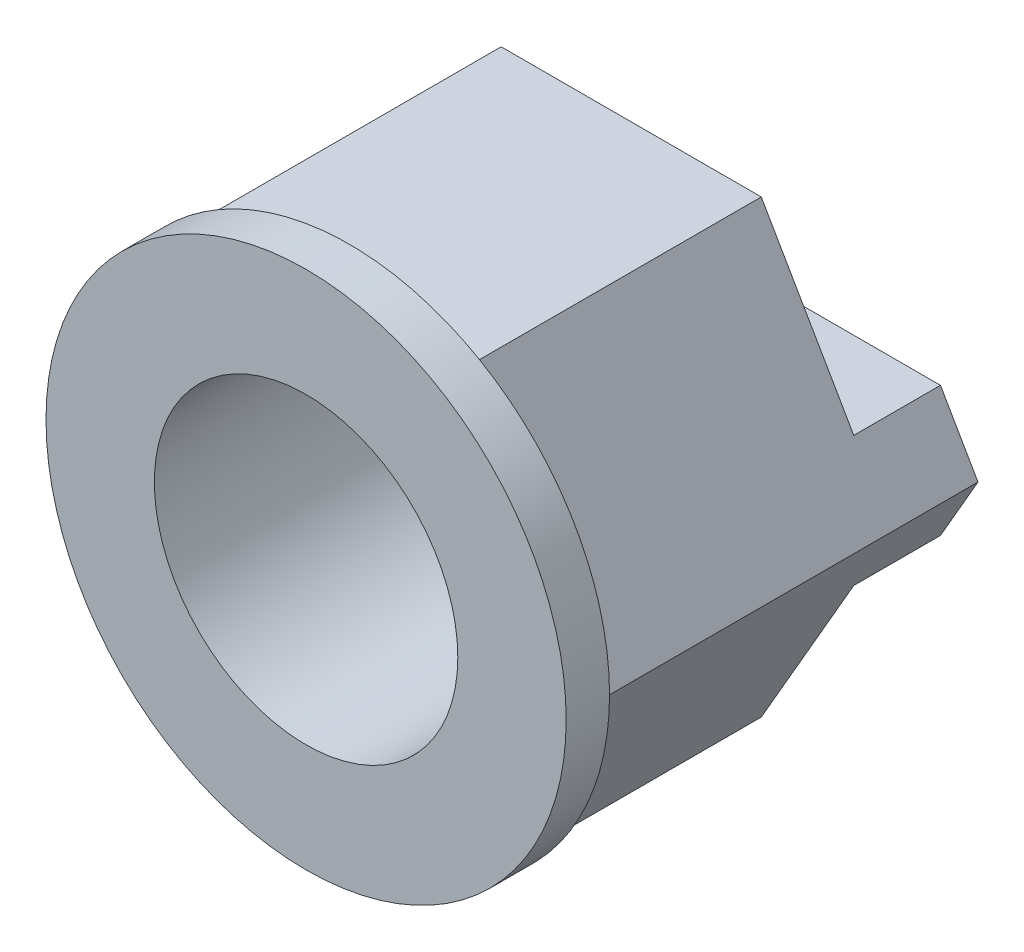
ISO-10303-21;
HEADER;
FILE_DESCRIPTION(('STEP AP214'),'2;1');
FILE_NAME('part.step','',(''),(''),'','','');
FILE_SCHEMA(('AUTOMOTIVE_DESIGN { 1 0 10303 214 1 1 1 1 }'));
ENDSEC;
DATA;
#1=APPLICATION_CONTEXT('core data for automotive mechanical design processes');
#2=APPLICATION_PROTOCOL_DEFINITION('international standard','automotive_design',2000,#1);
#3=PRODUCT_CONTEXT('',#1,'mechanical');
#4=PRODUCT('Part','Part','',(#3));
#5=PRODUCT_RELATED_PRODUCT_CATEGORY('part','',(#4));
#6=PRODUCT_DEFINITION_FORMATION('','',#4);
#7=PRODUCT_DEFINITION_CONTEXT('part definition',#1,'design');
#8=PRODUCT_DEFINITION('design','',#6,#7);
#9=PRODUCT_DEFINITION_SHAPE('','',#8);
#10=(LENGTH_UNIT() NAMED_UNIT(*) SI_UNIT(.MILLI.,.METRE.));
#11=(NAMED_UNIT(*) PLANE_ANGLE_UNIT() SI_UNIT($,.RADIAN.));
#12=(NAMED_UNIT(*) SI_UNIT($,.STERADIAN.) SOLID_ANGLE_UNIT());
#13=UNCERTAINTY_MEASURE_WITH_UNIT(LENGTH_MEASURE(1.E-05),#10,'distance_accuracy_value','');
#14=(GEOMETRIC_REPRESENTATION_CONTEXT(3) GLOBAL_UNCERTAINTY_ASSIGNED_CONTEXT((#13)) GLOBAL_UNIT_ASSIGNED_CONTEXT((#10,
#11,#12)) REPRESENTATION_CONTEXT('',''));
#15=CARTESIAN_POINT('',(0.,0.,0.));
#16=DIRECTION('',(0.,0.,1.));
#17=DIRECTION('',(1.,0.,0.));
#18=AXIS2_PLACEMENT_3D('',#15,#16,#17);
#19=CARTESIAN_POINT('',(0.,0.,-6.5));
#20=DIRECTION('',(0.,0.,1.));
#21=DIRECTION('',(1.,0.,0.));
#22=AXIS2_PLACEMENT_3D('',#19,#20,#21);
#23=PLANE('',#22);
#24=DIRECTION('',(0.,1.,0.));
#25=VECTOR('',#24,1.);
#26=CARTESIAN_POINT('',(1.2,0.,-6.5));
#27=LINE('',#26,#25);
#28=CARTESIAN_POINT('',(1.20000000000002,-3.28785644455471,-6.5));
#29=VERTEX_POINT('',#28);
#30=CARTESIAN_POINT('',(1.20000000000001,-1.59999999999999,-6.5));
#31=VERTEX_POINT('',#30);
#32=EDGE_CURVE('E318',#29,#31,#27,.T.);
#33=ORIENTED_EDGE('',*,*,#32,.F.);
#34=CARTESIAN_POINT('',(0.,0.,-6.5));
#35=DIRECTION('',(0.,0.,1.));
#36=DIRECTION('',(1.,0.,0.));
#37=AXIS2_PLACEMENT_3D('',#34,#35,#36);
#38=CIRCLE('',#37,3.5);
#39=CARTESIAN_POINT('',(3.09031657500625,1.6431504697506,-6.5));
#40=VERTEX_POINT('',#39);
#41=EDGE_CURVE('E317',#29,#40,#38,.T.);
#42=ORIENTED_EDGE('',*,*,#41,.T.);
#43=CARTESIAN_POINT('',(-0.95,3.36860505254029,-6.5));
#44=VERTEX_POINT('',#43);
#45=EDGE_CURVE('E414',#40,#44,#38,.T.);
#46=ORIENTED_EDGE('',*,*,#45,.T.);
#47=DIRECTION('',(0.,1.,0.));
#48=VECTOR('',#47,1.);
#49=CARTESIAN_POINT('',(-0.95,0.,-6.5));
#50=LINE('',#49,#48);
#51=CARTESIAN_POINT('',(-0.95,1.98431348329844,-6.5));
#52=VERTEX_POINT('',#51);
#53=EDGE_CURVE('E359',#52,#44,#50,.T.);
#54=ORIENTED_EDGE('',*,*,#53,.F.);
#55=CARTESIAN_POINT('',(-0.35,2.63535837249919,-6.5));
#56=DIRECTION('',(0.,0.,1.));
#57=DIRECTION('',(1.,0.,0.));
#58=AXIS2_PLACEMENT_3D('',#55,#56,#57);
#59=CIRCLE('',#58,0.885358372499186);
#60=CARTESIAN_POINT('',(0.25,1.98431348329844,-6.5));
#61=VERTEX_POINT('',#60);
#62=EDGE_CURVE('E328',#61,#52,#59,.F.);
#63=ORIENTED_EDGE('',*,*,#62,.F.);
#64=CARTESIAN_POINT('',(0.,0.,-6.5));
#65=DIRECTION('',(0.,0.,1.));
#66=DIRECTION('',(1.,0.,0.));
#67=AXIS2_PLACEMENT_3D('',#64,#65,#66);
#68=CIRCLE('',#67,2.);
#69=EDGE_CURVE('E259',#61,#31,#68,.F.);
#70=ORIENTED_EDGE('',*,*,#69,.T.);
#71=EDGE_LOOP('',(#33,#42,#46,#54,#63,#70));
#72=FACE_BOUND('',#71,.T.);
#73=ADVANCED_FACE('F33',(#72),#23,.T.);
#74=CARTESIAN_POINT('',(0.,0.,-9.000025));
#75=DIRECTION('',(0.,0.,1.));
#76=DIRECTION('',(1.,0.,0.));
#77=AXIS2_PLACEMENT_3D('',#74,#75,#76);
#78=CYLINDRICAL_SURFACE('',#77,2.);
#79=DIRECTION('',(0.,0.,1.));
#80=VECTOR('',#79,1.);
#81=CARTESIAN_POINT('',(1.20000000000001,-1.59999999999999,-9.000025));
#82=LINE('',#81,#80);
#83=CARTESIAN_POINT('',(1.20000000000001,-1.59999999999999,-7.));
#84=VERTEX_POINT('',#83);
#85=EDGE_CURVE('E290',#31,#84,#82,.F.);
#86=ORIENTED_EDGE('',*,*,#85,.F.);
#87=ORIENTED_EDGE('',*,*,#69,.F.);
#88=DIRECTION('',(0.,0.,1.));
#89=VECTOR('',#88,1.);
#90=CARTESIAN_POINT('',(0.25,1.98431348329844,-9.000025));
#91=LINE('',#90,#89);
#92=CARTESIAN_POINT('',(0.25,1.98431348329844,-7.));
#93=VERTEX_POINT('',#92);
#94=EDGE_CURVE('E287',#93,#61,#91,.T.);
#95=ORIENTED_EDGE('',*,*,#94,.F.);
#96=CARTESIAN_POINT('',(0.,0.,-7.));
#97=DIRECTION('',(0.,0.,1.));
#98=DIRECTION('',(1.,0.,0.));
#99=AXIS2_PLACEMENT_3D('',#96,#97,#98);
#100=CIRCLE('',#99,2.);
#101=CARTESIAN_POINT('',(1.32287565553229,1.5,-7.));
#102=VERTEX_POINT('',#101);
#103=EDGE_CURVE('E381',#93,#102,#100,.F.);
#104=ORIENTED_EDGE('',*,*,#103,.T.);
#105=DIRECTION('',(0.,0.,1.));
#106=VECTOR('',#105,1.);
#107=CARTESIAN_POINT('',(1.32287565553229,1.5,-9.000025));
#108=LINE('',#107,#106);
#109=CARTESIAN_POINT('',(1.32287565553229,1.5,-9.));
#110=VERTEX_POINT('',#109);
#111=EDGE_CURVE('E48',#102,#110,#108,.F.);
#112=ORIENTED_EDGE('',*,*,#111,.T.);
#113=CARTESIAN_POINT('',(0.,0.,-9.));
#114=DIRECTION('',(0.,0.,1.));
#115=DIRECTION('',(1.,0.,0.));
#116=AXIS2_PLACEMENT_3D('',#113,#114,#115);
#117=CIRCLE('',#116,2.);
#118=CARTESIAN_POINT('',(1.32287565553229,-1.5,-9.));
#119=VERTEX_POINT('',#118);
#120=EDGE_CURVE('E279',#110,#119,#117,.F.);
#121=ORIENTED_EDGE('',*,*,#120,.T.);
#122=DIRECTION('',(0.,0.,1.));
#123=VECTOR('',#122,1.);
#124=CARTESIAN_POINT('',(1.32287565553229,-1.5,-9.000025));
#125=LINE('',#124,#123);
#126=CARTESIAN_POINT('',(1.32287565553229,-1.5,-7.));
#127=VERTEX_POINT('',#126);
#128=EDGE_CURVE('E372',#119,#127,#125,.T.);
#129=ORIENTED_EDGE('',*,*,#128,.T.);
#130=CARTESIAN_POINT('',(0.,0.,-7.));
#131=DIRECTION('',(0.,0.,1.));
#132=DIRECTION('',(1.,0.,0.));
#133=AXIS2_PLACEMENT_3D('',#130,#131,#132);
#134=CIRCLE('',#133,2.);
#135=EDGE_CURVE('E375',#127,#84,#134,.F.);
#136=ORIENTED_EDGE('',*,*,#135,.T.);
#137=EDGE_LOOP('',(#86,#87,#95,#104,#112,#121,#129,#136));
#138=FACE_BOUND('',#137,.T.);
#139=ADVANCED_FACE('F581',(#138),#78,.F.);
#140=CARTESIAN_POINT('',(-5.13397459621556,-1.5,-9.));
#141=DIRECTION('',(0.,1.,0.));
#142=DIRECTION('',(-1.,0.,0.));
#143=AXIS2_PLACEMENT_3D('',#140,#141,#142);
#144=PLANE('',#143);
#145=DIRECTION('',(0.,0.,1.));
#146=VECTOR('',#145,1.);
#147=CARTESIAN_POINT('',(-1.32287565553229,-1.5,-9.000025));
#148=LINE('',#147,#146);
#149=CARTESIAN_POINT('',(-1.32287565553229,-1.5,-7.));
#150=VERTEX_POINT('',#149);
#151=CARTESIAN_POINT('',(-1.32287565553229,-1.5,-9.));
#152=VERTEX_POINT('',#151);
#153=EDGE_CURVE('E379',#150,#152,#148,.F.);
#154=ORIENTED_EDGE('',*,*,#153,.F.);
#155=DIRECTION('',(-1.,0.,0.));
#156=VECTOR('',#155,1.);
#157=CARTESIAN_POINT('',(-5.13397459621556,-1.5,-7.));
#158=LINE('',#157,#156);
#159=CARTESIAN_POINT('',(-5.13397459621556,-1.5,-7.));
#160=VERTEX_POINT('',#159);
#161=EDGE_CURVE('E263',#150,#160,#158,.T.);
#162=ORIENTED_EDGE('',*,*,#161,.T.);
#163=DIRECTION('',(0.,0.,1.));
#164=VECTOR('',#163,1.);
#165=CARTESIAN_POINT('',(-5.13397459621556,-1.5,-9.));
#166=LINE('',#165,#164);
#167=CARTESIAN_POINT('',(-5.13397459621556,-1.5,-9.));
#168=VERTEX_POINT('',#167);
#169=EDGE_CURVE('E530',#168,#160,#166,.T.);
#170=ORIENTED_EDGE('',*,*,#169,.F.);
#171=DIRECTION('',(-1.,0.,0.));
#172=VECTOR('',#171,1.);
#173=CARTESIAN_POINT('',(-5.13397459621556,-1.5,-9.));
#174=LINE('',#173,#172);
#175=EDGE_CURVE('E514',#152,#168,#174,.T.);
#176=ORIENTED_EDGE('',*,*,#175,.F.);
#177=EDGE_LOOP('',(#154,#162,#170,#176));
#178=FACE_BOUND('',#177,.T.);
#179=ADVANCED_FACE('F587',(#178),#144,.F.);
#180=CARTESIAN_POINT('',(-5.13397459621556,1.5,-9.));
#181=DIRECTION('',(0.,-1.,0.));
#182=DIRECTION('',(1.,0.,0.));
#183=AXIS2_PLACEMENT_3D('',#180,#181,#182);
#184=PLANE('',#183);
#185=ORIENTED_EDGE('',*,*,#111,.F.);
#186=DIRECTION('',(1.,0.,0.));
#187=VECTOR('',#186,1.);
#188=CARTESIAN_POINT('',(-5.13397459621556,1.5,-7.));
#189=LINE('',#188,#187);
#190=CARTESIAN_POINT('',(5.13397459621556,1.5,-7.));
#191=VERTEX_POINT('',#190);
#192=EDGE_CURVE('E281',#102,#191,#189,.T.);
#193=ORIENTED_EDGE('',*,*,#192,.T.);
#194=DIRECTION('',(0.,0.,1.));
#195=VECTOR('',#194,1.);
#196=CARTESIAN_POINT('',(5.13397459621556,1.5,-9.));
#197=LINE('',#196,#195);
#198=CARTESIAN_POINT('',(5.13397459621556,1.5,-9.));
#199=VERTEX_POINT('',#198);
#200=EDGE_CURVE('E405',#199,#191,#197,.T.);
#201=ORIENTED_EDGE('',*,*,#200,.F.);
#202=DIRECTION('',(1.,0.,0.));
#203=VECTOR('',#202,1.);
#204=CARTESIAN_POINT('',(-5.13397459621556,1.5,-9.));
#205=LINE('',#204,#203);
#206=EDGE_CURVE('E402',#110,#199,#205,.T.);
#207=ORIENTED_EDGE('',*,*,#206,.F.);
#208=EDGE_LOOP('',(#185,#193,#201,#207));
#209=FACE_BOUND('',#208,.T.);
#210=ADVANCED_FACE('F559',(#209),#184,.F.);
#211=CARTESIAN_POINT('',(6.86602540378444,1.5,-9.));
#212=DIRECTION('',(0.,0.,1.));
#213=DIRECTION('',(1.,0.,0.));
#214=AXIS2_PLACEMENT_3D('',#211,#212,#213);
#215=PLANE('',#214);
#216=CARTESIAN_POINT('',(0.,0.,-9.));
#217=DIRECTION('',(0.,0.,1.));
#218=DIRECTION('',(1.,0.,0.));
#219=AXIS2_PLACEMENT_3D('',#216,#217,#218);
#220=CIRCLE('',#219,2.);
#221=CARTESIAN_POINT('',(-1.32287565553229,1.5,-9.));
#222=VERTEX_POINT('',#221);
#223=EDGE_CURVE('E264',#152,#222,#220,.F.);
#224=ORIENTED_EDGE('',*,*,#223,.F.);
#225=ORIENTED_EDGE('',*,*,#175,.T.);
#226=DIRECTION('',(-0.5,0.866025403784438,0.));
#227=VECTOR('',#226,1.);
#228=CARTESIAN_POINT('',(-5.13397459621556,-1.5,-9.));
#229=LINE('',#228,#227);
#230=CARTESIAN_POINT('',(-6.,0.,-9.));
#231=VERTEX_POINT('',#230);
#232=EDGE_CURVE('E511',#168,#231,#229,.T.);
#233=ORIENTED_EDGE('',*,*,#232,.T.);
#234=DIRECTION('',(0.5,0.866025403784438,0.));
#235=VECTOR('',#234,1.);
#236=CARTESIAN_POINT('',(-6.,0.,-9.));
#237=LINE('',#236,#235);
#238=CARTESIAN_POINT('',(-5.13397459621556,1.5,-9.));
#239=VERTEX_POINT('',#238);
#240=EDGE_CURVE('E399',#231,#239,#237,.T.);
#241=ORIENTED_EDGE('',*,*,#240,.T.);
#242=EDGE_CURVE('E395',#239,#222,#205,.T.);
#243=ORIENTED_EDGE('',*,*,#242,.T.);
#244=EDGE_LOOP('',(#224,#225,#233,#241,#243));
#245=FACE_BOUND('',#244,.T.);
#246=ADVANCED_FACE('F396',(#245),#215,.F.);
#247=CARTESIAN_POINT('',(3.,-5.19615242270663,-7.));
#248=DIRECTION('',(0.,0.,1.));
#249=DIRECTION('',(1.,0.,0.));
#250=AXIS2_PLACEMENT_3D('',#247,#248,#249);
#251=PLANE('',#250);
#252=ORIENTED_EDGE('',*,*,#103,.F.);
#253=CARTESIAN_POINT('',(-0.35,2.63535837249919,-7.));
#254=DIRECTION('',(0.,0.,-1.));
#255=DIRECTION('',(-1.,0.,0.));
#256=AXIS2_PLACEMENT_3D('',#253,#254,#255);
#257=CIRCLE('',#256,0.885358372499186);
#258=CARTESIAN_POINT('',(-0.95,1.98431348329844,-7.));
#259=VERTEX_POINT('',#258);
#260=EDGE_CURVE('E320',#93,#259,#257,.T.);
#261=ORIENTED_EDGE('',*,*,#260,.T.);
#262=DIRECTION('',(0.,-1.,0.));
#263=VECTOR('',#262,1.);
#264=CARTESIAN_POINT('',(-0.95,3.36860505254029,-7.));
#265=LINE('',#264,#263);
#266=CARTESIAN_POINT('',(-0.95,3.36860505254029,-7.));
#267=VERTEX_POINT('',#266);
#268=EDGE_CURVE('E340',#267,#259,#265,.T.);
#269=ORIENTED_EDGE('',*,*,#268,.F.);
#270=CARTESIAN_POINT('',(0.,0.,-7.));
#271=DIRECTION('',(0.,0.,1.));
#272=DIRECTION('',(-1.,0.,0.));
#273=AXIS2_PLACEMENT_3D('',#270,#271,#272);
#274=CIRCLE('',#273,3.5);
#275=CARTESIAN_POINT('',(3.09031657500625,1.6431504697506,-7.));
#276=VERTEX_POINT('',#275);
#277=EDGE_CURVE('E337',#276,#267,#274,.T.);
#278=ORIENTED_EDGE('',*,*,#277,.F.);
#279=CARTESIAN_POINT('',(3.20068502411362,1.70183441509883,-7.));
#280=DIRECTION('',(0.,0.,-1.));
#281=DIRECTION('',(-1.,0.,0.));
#282=AXIS2_PLACEMENT_3D('',#279,#280,#281);
#283=CIRCLE('',#282,0.125);
#284=CARTESIAN_POINT('',(3.31105347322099,1.76051836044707,-7.));
#285=VERTEX_POINT('',#284);
#286=EDGE_CURVE('E334',#285,#276,#283,.T.);
#287=ORIENTED_EDGE('',*,*,#286,.F.);
#288=CARTESIAN_POINT('',(0.,0.,-7.));
#289=DIRECTION('',(0.,0.,-1.));
#290=DIRECTION('',(-1.,0.,0.));
#291=AXIS2_PLACEMENT_3D('',#288,#289,#290);
#292=CIRCLE('',#291,3.75);
#293=CARTESIAN_POINT('',(-1.2,3.5528157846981,-7.));
#294=VERTEX_POINT('',#293);
#295=EDGE_CURVE('E345',#294,#285,#292,.T.);
#296=ORIENTED_EDGE('',*,*,#295,.F.);
#297=DIRECTION('',(0.,1.,0.));
#298=VECTOR('',#297,1.);
#299=CARTESIAN_POINT('',(-1.2,1.6,-7.));
#300=LINE('',#299,#298);
#301=CARTESIAN_POINT('',(-1.2,1.6,-7.));
#302=VERTEX_POINT('',#301);
#303=EDGE_CURVE('E342',#302,#294,#300,.T.);
#304=ORIENTED_EDGE('',*,*,#303,.F.);
#305=CARTESIAN_POINT('',(-1.32287565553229,1.5,-7.));
#306=VERTEX_POINT('',#305);
#307=EDGE_CURVE('E382',#306,#302,#100,.F.);
#308=ORIENTED_EDGE('',*,*,#307,.F.);
#309=CARTESIAN_POINT('',(-5.13397459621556,1.5,-7.));
#310=VERTEX_POINT('',#309);
#311=EDGE_CURVE('E283',#310,#306,#189,.T.);
#312=ORIENTED_EDGE('',*,*,#311,.F.);
#313=DIRECTION('',(0.5,0.866025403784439,0.));
#314=VECTOR('',#313,1.);
#315=CARTESIAN_POINT('',(-6.,0.,-7.));
#316=LINE('',#315,#314);
#317=CARTESIAN_POINT('',(-3.,5.19615242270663,-7.));
#318=VERTEX_POINT('',#317);
#319=EDGE_CURVE('E448',#310,#318,#316,.T.);
#320=ORIENTED_EDGE('',*,*,#319,.T.);
#321=DIRECTION('',(1.,0.,0.));
#322=VECTOR('',#321,1.);
#323=CARTESIAN_POINT('',(-3.,5.19615242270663,-7.));
#324=LINE('',#323,#322);
#325=CARTESIAN_POINT('',(3.,5.19615242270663,-7.));
#326=VERTEX_POINT('',#325);
#327=EDGE_CURVE('E452',#318,#326,#324,.T.);
#328=ORIENTED_EDGE('',*,*,#327,.T.);
#329=DIRECTION('',(0.5,-0.866025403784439,0.));
#330=VECTOR('',#329,1.);
#331=CARTESIAN_POINT('',(3.,5.19615242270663,-7.));
#332=LINE('',#331,#330);
#333=EDGE_CURVE('E453',#326,#191,#332,.T.);
#334=ORIENTED_EDGE('',*,*,#333,.T.);
#335=ORIENTED_EDGE('',*,*,#192,.F.);
#336=EDGE_LOOP('',(#252,#261,#269,#278,#287,#296,#304,#308,#312,#320,#328,#334,#335));
#337=FACE_BOUND('',#336,.T.);
#338=ADVANCED_FACE('F565',(#337),#251,.F.);
#339=CARTESIAN_POINT('',(-0.249999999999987,-1.98431348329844,-7.));
#340=VERTEX_POINT('',#339);
#341=EDGE_CURVE('E374',#340,#150,#134,.F.);
#342=ORIENTED_EDGE('',*,*,#341,.F.);
#343=CARTESIAN_POINT('',(0.350000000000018,-2.63535837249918,-7.));
#344=DIRECTION('',(0.,0.,-1.));
#345=DIRECTION('',(1.,0.,0.));
#346=AXIS2_PLACEMENT_3D('',#343,#344,#345);
#347=CIRCLE('',#346,0.885358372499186);
#348=CARTESIAN_POINT('',(0.950000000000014,-1.98431348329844,-7.));
#349=VERTEX_POINT('',#348);
#350=EDGE_CURVE('E248',#340,#349,#347,.T.);
#351=ORIENTED_EDGE('',*,*,#350,.T.);
#352=DIRECTION('',(0.,1.,0.));
#353=VECTOR('',#352,1.);
#354=CARTESIAN_POINT('',(0.950000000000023,-3.36860505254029,-7.));
#355=LINE('',#354,#353);
#356=CARTESIAN_POINT('',(0.950000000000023,-3.36860505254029,-7.));
#357=VERTEX_POINT('',#356);
#358=EDGE_CURVE('E646',#357,#349,#355,.T.);
#359=ORIENTED_EDGE('',*,*,#358,.F.);
#360=CARTESIAN_POINT('',(0.,0.,-7.));
#361=DIRECTION('',(0.,0.,1.));
#362=DIRECTION('',(1.,0.,0.));
#363=AXIS2_PLACEMENT_3D('',#360,#361,#362);
#364=CIRCLE('',#363,3.5);
#365=CARTESIAN_POINT('',(-3.09031657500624,-1.64315046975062,-7.));
#366=VERTEX_POINT('',#365);
#367=EDGE_CURVE('E653',#366,#357,#364,.T.);
#368=ORIENTED_EDGE('',*,*,#367,.F.);
#369=CARTESIAN_POINT('',(-3.20068502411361,-1.70183441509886,-7.));
#370=DIRECTION('',(0.,0.,-1.));
#371=DIRECTION('',(1.,0.,0.));
#372=AXIS2_PLACEMENT_3D('',#369,#370,#371);
#373=CIRCLE('',#372,0.125);
#374=CARTESIAN_POINT('',(-3.31105347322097,-1.76051836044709,-7.));
#375=VERTEX_POINT('',#374);
#376=EDGE_CURVE('E650',#375,#366,#373,.T.);
#377=ORIENTED_EDGE('',*,*,#376,.F.);
#378=CARTESIAN_POINT('',(0.,0.,-7.));
#379=DIRECTION('',(0.,0.,-1.));
#380=DIRECTION('',(1.,0.,0.));
#381=AXIS2_PLACEMENT_3D('',#378,#379,#380);
#382=CIRCLE('',#381,3.75);
#383=CARTESIAN_POINT('',(1.20000000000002,-3.5528157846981,-7.));
#384=VERTEX_POINT('',#383);
#385=EDGE_CURVE('E659',#384,#375,#382,.T.);
#386=ORIENTED_EDGE('',*,*,#385,.F.);
#387=DIRECTION('',(0.,-1.,0.));
#388=VECTOR('',#387,1.);
#389=CARTESIAN_POINT('',(1.20000000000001,-1.59999999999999,-7.));
#390=LINE('',#389,#388);
#391=EDGE_CURVE('E657',#84,#384,#390,.T.);
#392=ORIENTED_EDGE('',*,*,#391,.F.);
#393=ORIENTED_EDGE('',*,*,#135,.F.);
#394=CARTESIAN_POINT('',(5.13397459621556,-1.5,-7.));
#395=VERTEX_POINT('',#394);
#396=EDGE_CURVE('E56',#395,#127,#158,.T.);
#397=ORIENTED_EDGE('',*,*,#396,.F.);
#398=DIRECTION('',(-0.5,-0.866025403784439,0.));
#399=VECTOR('',#398,1.);
#400=CARTESIAN_POINT('',(6.,0.,-7.));
#401=LINE('',#400,#399);
#402=CARTESIAN_POINT('',(3.,-5.19615242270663,-7.));
#403=VERTEX_POINT('',#402);
#404=EDGE_CURVE('E456',#395,#403,#401,.T.);
#405=ORIENTED_EDGE('',*,*,#404,.T.);
#406=DIRECTION('',(-1.,0.,0.));
#407=VECTOR('',#406,1.);
#408=CARTESIAN_POINT('',(3.,-5.19615242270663,-7.));
#409=LINE('',#408,#407);
#410=CARTESIAN_POINT('',(-3.,-5.19615242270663,-7.));
#411=VERTEX_POINT('',#410);
#412=EDGE_CURVE('E436',#403,#411,#409,.T.);
#413=ORIENTED_EDGE('',*,*,#412,.T.);
#414=DIRECTION('',(-0.5,0.866025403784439,0.));
#415=VECTOR('',#414,1.);
#416=CARTESIAN_POINT('',(-3.,-5.19615242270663,-7.));
#417=LINE('',#416,#415);
#418=EDGE_CURVE('E439',#411,#160,#417,.T.);
#419=ORIENTED_EDGE('',*,*,#418,.T.);
#420=ORIENTED_EDGE('',*,*,#161,.F.);
#421=EDGE_LOOP('',(#342,#351,#359,#368,#377,#386,#392,#393,#397,#405,#413,#419,#420));
#422=FACE_BOUND('',#421,.T.);
#423=ADVANCED_FACE('F544',(#422),#251,.F.);
#424=CARTESIAN_POINT('',(0.350000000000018,-2.63535837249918,-6.5));
#425=DIRECTION('',(0.,0.,1.));
#426=DIRECTION('',(1.,0.,0.));
#427=AXIS2_PLACEMENT_3D('',#424,#425,#426);
#428=CIRCLE('',#427,0.885358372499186);
#429=CARTESIAN_POINT('',(-0.249999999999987,-1.98431348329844,-6.5));
#430=VERTEX_POINT('',#429);
#431=CARTESIAN_POINT('',(0.950000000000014,-1.98431348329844,-6.5));
#432=VERTEX_POINT('',#431);
#433=EDGE_CURVE('E236',#430,#432,#428,.F.);
#434=ORIENTED_EDGE('',*,*,#433,.F.);
#435=CARTESIAN_POINT('',(-1.2,1.6,-6.5));
#436=VERTEX_POINT('',#435);
#437=EDGE_CURVE('E240',#430,#436,#68,.F.);
#438=ORIENTED_EDGE('',*,*,#437,.T.);
#439=DIRECTION('',(0.,-1.,0.));
#440=VECTOR('',#439,1.);
#441=CARTESIAN_POINT('',(-1.2,0.,-6.5));
#442=LINE('',#441,#440);
#443=CARTESIAN_POINT('',(-1.2,3.28785644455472,-6.5));
#444=VERTEX_POINT('',#443);
#445=EDGE_CURVE('E370',#444,#436,#442,.T.);
#446=ORIENTED_EDGE('',*,*,#445,.F.);
#447=CARTESIAN_POINT('',(-3.09031657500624,-1.64315046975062,-6.5));
#448=VERTEX_POINT('',#447);
#449=EDGE_CURVE('E418',#444,#448,#38,.T.);
#450=ORIENTED_EDGE('',*,*,#449,.T.);
#451=CARTESIAN_POINT('',(0.950000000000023,-3.36860505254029,-6.5));
#452=VERTEX_POINT('',#451);
#453=EDGE_CURVE('E675',#448,#452,#38,.T.);
#454=ORIENTED_EDGE('',*,*,#453,.T.);
#455=DIRECTION('',(0.,-1.,0.));
#456=VECTOR('',#455,1.);
#457=CARTESIAN_POINT('',(0.95,0.,-6.5));
#458=LINE('',#457,#456);
#459=EDGE_CURVE('E243',#432,#452,#458,.T.);
#460=ORIENTED_EDGE('',*,*,#459,.F.);
#461=EDGE_LOOP('',(#434,#438,#446,#450,#454,#460));
#462=FACE_BOUND('',#461,.T.);
#463=ADVANCED_FACE('F237',(#462),#23,.T.);
#464=ORIENTED_EDGE('',*,*,#128,.F.);
#465=CARTESIAN_POINT('',(5.13397459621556,-1.5,-9.));
#466=VERTEX_POINT('',#465);
#467=EDGE_CURVE('E512',#466,#119,#174,.T.);
#468=ORIENTED_EDGE('',*,*,#467,.F.);
#469=DIRECTION('',(0.,0.,1.));
#470=VECTOR('',#469,1.);
#471=CARTESIAN_POINT('',(5.13397459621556,-1.5,-9.));
#472=LINE('',#471,#470);
#473=EDGE_CURVE('E413',#466,#395,#472,.T.);
#474=ORIENTED_EDGE('',*,*,#473,.T.);
#475=ORIENTED_EDGE('',*,*,#396,.T.);
#476=EDGE_LOOP('',(#464,#468,#474,#475));
#477=FACE_BOUND('',#476,.T.);
#478=ADVANCED_FACE('F539',(#477),#144,.F.);
#479=DIRECTION('',(0.,0.,1.));
#480=VECTOR('',#479,1.);
#481=CARTESIAN_POINT('',(-1.32287565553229,1.5,-9.000025));
#482=LINE('',#481,#480);
#483=EDGE_CURVE('E260',#222,#306,#482,.T.);
#484=ORIENTED_EDGE('',*,*,#483,.F.);
#485=ORIENTED_EDGE('',*,*,#242,.F.);
#486=DIRECTION('',(0.,0.,1.));
#487=VECTOR('',#486,1.);
#488=CARTESIAN_POINT('',(-5.13397459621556,1.5,-9.));
#489=LINE('',#488,#487);
#490=EDGE_CURVE('E510',#239,#310,#489,.T.);
#491=ORIENTED_EDGE('',*,*,#490,.T.);
#492=ORIENTED_EDGE('',*,*,#311,.T.);
#493=EDGE_LOOP('',(#484,#485,#491,#492));
#494=FACE_BOUND('',#493,.T.);
#495=ADVANCED_FACE('F393',(#494),#184,.F.);
#496=ORIENTED_EDGE('',*,*,#120,.F.);
#497=ORIENTED_EDGE('',*,*,#206,.T.);
#498=DIRECTION('',(0.5,-0.866025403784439,0.));
#499=VECTOR('',#498,1.);
#500=CARTESIAN_POINT('',(5.13397459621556,1.5,-9.));
#501=LINE('',#500,#499);
#502=CARTESIAN_POINT('',(6.,0.,-9.));
#503=VERTEX_POINT('',#502);
#504=EDGE_CURVE('E401',#199,#503,#501,.T.);
#505=ORIENTED_EDGE('',*,*,#504,.T.);
#506=DIRECTION('',(-0.499999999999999,-0.866025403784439,0.));
#507=VECTOR('',#506,1.);
#508=CARTESIAN_POINT('',(6.,0.,-9.));
#509=LINE('',#508,#507);
#510=EDGE_CURVE('E516',#503,#466,#509,.T.);
#511=ORIENTED_EDGE('',*,*,#510,.T.);
#512=ORIENTED_EDGE('',*,*,#467,.T.);
#513=EDGE_LOOP('',(#496,#497,#505,#511,#512));
#514=FACE_BOUND('',#513,.T.);
#515=ADVANCED_FACE('F555',(#514),#215,.F.);
#516=CARTESIAN_POINT('',(0.,0.,-0.5));
#517=DIRECTION('',(0.,0.,1.));
#518=DIRECTION('',(1.,0.,0.));
#519=AXIS2_PLACEMENT_3D('',#516,#517,#518);
#520=PLANE('',#519);
#521=DIRECTION('',(-1.,0.,0.));
#522=VECTOR('',#521,1.);
#523=CARTESIAN_POINT('',(3.,-5.19615242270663,-0.5));
#524=LINE('',#523,#522);
#525=CARTESIAN_POINT('',(3.,-5.19615242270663,-0.5));
#526=VERTEX_POINT('',#525);
#527=CARTESIAN_POINT('',(-3.,-5.19615242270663,-0.5));
#528=VERTEX_POINT('',#527);
#529=EDGE_CURVE('E417',#526,#528,#524,.T.);
#530=ORIENTED_EDGE('',*,*,#529,.F.);
#531=CARTESIAN_POINT('',(0.,0.,-0.5));
#532=DIRECTION('',(0.,0.,1.));
#533=DIRECTION('',(1.,0.,0.));
#534=AXIS2_PLACEMENT_3D('',#531,#532,#533);
#535=CIRCLE('',#534,6.);
#536=EDGE_CURVE('E488',#528,#526,#535,.T.);
#537=ORIENTED_EDGE('',*,*,#536,.F.);
#538=EDGE_LOOP('',(#530,#537));
#539=FACE_BOUND('',#538,.T.);
#540=ADVANCED_FACE('F549',(#539),#520,.F.);
#541=DIRECTION('',(-0.5,-0.866025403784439,0.));
#542=VECTOR('',#541,1.);
#543=CARTESIAN_POINT('',(6.,0.,-0.5));
#544=LINE('',#543,#542);
#545=CARTESIAN_POINT('',(6.,0.,-0.5));
#546=VERTEX_POINT('',#545);
#547=EDGE_CURVE('E433',#546,#526,#544,.T.);
#548=ORIENTED_EDGE('',*,*,#547,.F.);
#549=EDGE_CURVE('E478',#526,#546,#535,.T.);
#550=ORIENTED_EDGE('',*,*,#549,.F.);
#551=EDGE_LOOP('',(#548,#550));
#552=FACE_BOUND('',#551,.T.);
#553=ADVANCED_FACE('F551',(#552),#520,.F.);
#554=DIRECTION('',(0.5,-0.866025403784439,0.));
#555=VECTOR('',#554,1.);
#556=CARTESIAN_POINT('',(3.,5.19615242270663,-0.5));
#557=LINE('',#556,#555);
#558=CARTESIAN_POINT('',(3.,5.19615242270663,-0.5));
#559=VERTEX_POINT('',#558);
#560=EDGE_CURVE('E430',#559,#546,#557,.T.);
#561=ORIENTED_EDGE('',*,*,#560,.F.);
#562=EDGE_CURVE('E479',#546,#559,#535,.T.);
#563=ORIENTED_EDGE('',*,*,#562,.F.);
#564=EDGE_LOOP('',(#561,#563));
#565=FACE_BOUND('',#564,.T.);
#566=ADVANCED_FACE('F572',(#565),#520,.F.);
#567=DIRECTION('',(1.,0.,0.));
#568=VECTOR('',#567,1.);
#569=CARTESIAN_POINT('',(-3.,5.19615242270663,-0.5));
#570=LINE('',#569,#568);
#571=CARTESIAN_POINT('',(-3.,5.19615242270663,-0.5));
#572=VERTEX_POINT('',#571);
#573=EDGE_CURVE('E427',#572,#559,#570,.T.);
#574=ORIENTED_EDGE('',*,*,#573,.F.);
#575=EDGE_CURVE('E481',#559,#572,#535,.T.);
#576=ORIENTED_EDGE('',*,*,#575,.F.);
#577=EDGE_LOOP('',(#574,#576));
#578=FACE_BOUND('',#577,.T.);
#579=ADVANCED_FACE('F570',(#578),#520,.F.);
#580=DIRECTION('',(0.5,0.866025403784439,0.));
#581=VECTOR('',#580,1.);
#582=CARTESIAN_POINT('',(-6.,0.,-0.5));
#583=LINE('',#582,#581);
#584=CARTESIAN_POINT('',(-6.,0.,-0.5));
#585=VERTEX_POINT('',#584);
#586=EDGE_CURVE('E424',#585,#572,#583,.T.);
#587=ORIENTED_EDGE('',*,*,#586,.F.);
#588=EDGE_CURVE('E487',#572,#585,#535,.T.);
#589=ORIENTED_EDGE('',*,*,#588,.F.);
#590=EDGE_LOOP('',(#587,#589));
#591=FACE_BOUND('',#590,.T.);
#592=ADVANCED_FACE('F501',(#591),#520,.F.);
#593=DIRECTION('',(-0.5,0.866025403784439,0.));
#594=VECTOR('',#593,1.);
#595=CARTESIAN_POINT('',(-3.,-5.19615242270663,-0.5));
#596=LINE('',#595,#594);
#597=EDGE_CURVE('E421',#528,#585,#596,.T.);
#598=ORIENTED_EDGE('',*,*,#597,.F.);
#599=EDGE_CURVE('E491',#585,#528,#535,.T.);
#600=ORIENTED_EDGE('',*,*,#599,.F.);
#601=EDGE_LOOP('',(#598,#600));
#602=FACE_BOUND('',#601,.T.);
#603=ADVANCED_FACE('F500',(#602),#520,.F.);
#604=CARTESIAN_POINT('',(0.,0.,0.5));
#605=DIRECTION('',(0.,0.,-1.));
#606=DIRECTION('',(-1.,0.,0.));
#607=AXIS2_PLACEMENT_3D('',#604,#605,#606);
#608=CYLINDRICAL_SURFACE('',#607,6.);
#609=CARTESIAN_POINT('',(0.,0.,0.5));
#610=DIRECTION('',(0.,0.,1.));
#611=DIRECTION('',(1.,0.,0.));
#612=AXIS2_PLACEMENT_3D('',#609,#610,#611);
#613=CIRCLE('',#612,6.);
#614=CARTESIAN_POINT('',(6.,0.,0.5));
#615=VERTEX_POINT('',#614);
#616=EDGE_CURVE('E449',#615,#615,#613,.T.);
#617=ORIENTED_EDGE('',*,*,#616,.F.);
#618=EDGE_LOOP('',(#617));
#619=FACE_BOUND('',#618,.T.);
#620=ORIENTED_EDGE('',*,*,#562,.T.);
#621=ORIENTED_EDGE('',*,*,#575,.T.);
#622=ORIENTED_EDGE('',*,*,#588,.T.);
#623=ORIENTED_EDGE('',*,*,#599,.T.);
#624=ORIENTED_EDGE('',*,*,#536,.T.);
#625=ORIENTED_EDGE('',*,*,#549,.T.);
#626=EDGE_LOOP('',(#620,#621,#622,#623,#624,#625));
#627=FACE_BOUND('',#626,.T.);
#628=ADVANCED_FACE('F35',(#619,#627),#608,.T.);
#629=CARTESIAN_POINT('',(0.,0.,0.5));
#630=DIRECTION('',(0.,0.,1.));
#631=DIRECTION('',(1.,0.,0.));
#632=AXIS2_PLACEMENT_3D('',#629,#630,#631);
#633=PLANE('',#632);
#634=CARTESIAN_POINT('',(0.,0.,0.5));
#635=DIRECTION('',(0.,0.,1.));
#636=DIRECTION('',(1.,0.,0.));
#637=AXIS2_PLACEMENT_3D('',#634,#635,#636);
#638=CIRCLE('',#637,3.5);
#639=CARTESIAN_POINT('',(3.5,0.,0.5));
#640=VERTEX_POINT('',#639);
#641=EDGE_CURVE('E410',#640,#640,#638,.T.);
#642=ORIENTED_EDGE('',*,*,#641,.F.);
#643=EDGE_LOOP('',(#642));
#644=FACE_BOUND('',#643,.T.);
#645=ORIENTED_EDGE('',*,*,#616,.T.);
#646=EDGE_LOOP('',(#645));
#647=FACE_BOUND('',#646,.T.);
#648=ADVANCED_FACE('F611',(#644,#647),#633,.T.);
#649=CARTESIAN_POINT('',(3.,-5.19615242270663,-7.));
#650=DIRECTION('',(0.,1.,0.));
#651=DIRECTION('',(0.,0.,1.));
#652=AXIS2_PLACEMENT_3D('',#649,#650,#651);
#653=PLANE('',#652);
#654=ORIENTED_EDGE('',*,*,#529,.T.);
#655=DIRECTION('',(0.,0.,1.));
#656=VECTOR('',#655,1.);
#657=CARTESIAN_POINT('',(-3.,-5.19615242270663,-7.));
#658=LINE('',#657,#656);
#659=EDGE_CURVE('E476',#411,#528,#658,.T.);
#660=ORIENTED_EDGE('',*,*,#659,.F.);
#661=ORIENTED_EDGE('',*,*,#412,.F.);
#662=DIRECTION('',(0.,0.,1.));
#663=VECTOR('',#662,1.);
#664=CARTESIAN_POINT('',(3.,-5.19615242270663,-7.));
#665=LINE('',#664,#663);
#666=EDGE_CURVE('E461',#403,#526,#665,.T.);
#667=ORIENTED_EDGE('',*,*,#666,.T.);
#668=EDGE_LOOP('',(#654,#660,#661,#667));
#669=FACE_BOUND('',#668,.T.);
#670=ADVANCED_FACE('F547',(#669),#653,.F.);
#671=CARTESIAN_POINT('',(-3.,-5.19615242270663,-7.));
#672=DIRECTION('',(0.866025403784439,0.5,0.));
#673=DIRECTION('',(-0.5,0.866025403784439,0.));
#674=AXIS2_PLACEMENT_3D('',#671,#672,#673);
#675=PLANE('',#674);
#676=ORIENTED_EDGE('',*,*,#597,.T.);
#677=DIRECTION('',(0.,0.,1.));
#678=VECTOR('',#677,1.);
#679=CARTESIAN_POINT('',(-6.,0.,-7.));
#680=LINE('',#679,#678);
#681=EDGE_CURVE('E473',#231,#585,#680,.T.);
#682=ORIENTED_EDGE('',*,*,#681,.F.);
#683=ORIENTED_EDGE('',*,*,#232,.F.);
#684=ORIENTED_EDGE('',*,*,#169,.T.);
#685=ORIENTED_EDGE('',*,*,#418,.F.);
#686=ORIENTED_EDGE('',*,*,#659,.T.);
#687=EDGE_LOOP('',(#676,#682,#683,#684,#685,#686));
#688=FACE_BOUND('',#687,.T.);
#689=ADVANCED_FACE('F505',(#688),#675,.F.);
#690=CARTESIAN_POINT('',(-6.,0.,-7.));
#691=DIRECTION('',(0.866025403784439,-0.5,0.));
#692=DIRECTION('',(0.5,0.866025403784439,0.));
#693=AXIS2_PLACEMENT_3D('',#690,#691,#692);
#694=PLANE('',#693);
#695=ORIENTED_EDGE('',*,*,#586,.T.);
#696=DIRECTION('',(0.,0.,1.));
#697=VECTOR('',#696,1.);
#698=CARTESIAN_POINT('',(-3.,5.19615242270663,-7.));
#699=LINE('',#698,#697);
#700=EDGE_CURVE('E470',#318,#572,#699,.T.);
#701=ORIENTED_EDGE('',*,*,#700,.F.);
#702=ORIENTED_EDGE('',*,*,#319,.F.);
#703=ORIENTED_EDGE('',*,*,#490,.F.);
#704=ORIENTED_EDGE('',*,*,#240,.F.);
#705=ORIENTED_EDGE('',*,*,#681,.T.);
#706=EDGE_LOOP('',(#695,#701,#702,#703,#704,#705));
#707=FACE_BOUND('',#706,.T.);
#708=ADVANCED_FACE('F508',(#707),#694,.F.);
#709=CARTESIAN_POINT('',(-3.,5.19615242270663,-7.));
#710=DIRECTION('',(0.,-1.,0.));
#711=DIRECTION('',(1.,0.,0.));
#712=AXIS2_PLACEMENT_3D('',#709,#710,#711);
#713=PLANE('',#712);
#714=ORIENTED_EDGE('',*,*,#573,.T.);
#715=DIRECTION('',(0.,0.,1.));
#716=VECTOR('',#715,1.);
#717=CARTESIAN_POINT('',(3.,5.19615242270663,-7.));
#718=LINE('',#717,#716);
#719=EDGE_CURVE('E467',#326,#559,#718,.T.);
#720=ORIENTED_EDGE('',*,*,#719,.F.);
#721=ORIENTED_EDGE('',*,*,#327,.F.);
#722=ORIENTED_EDGE('',*,*,#700,.T.);
#723=EDGE_LOOP('',(#714,#720,#721,#722));
#724=FACE_BOUND('',#723,.T.);
#725=ADVANCED_FACE('F568',(#724),#713,.F.);
#726=CARTESIAN_POINT('',(3.,5.19615242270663,-7.));
#727=DIRECTION('',(-0.866025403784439,-0.5,0.));
#728=DIRECTION('',(0.5,-0.866025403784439,0.));
#729=AXIS2_PLACEMENT_3D('',#726,#727,#728);
#730=PLANE('',#729);
#731=ORIENTED_EDGE('',*,*,#560,.T.);
#732=DIRECTION('',(0.,0.,1.));
#733=VECTOR('',#732,1.);
#734=CARTESIAN_POINT('',(6.,0.,-7.));
#735=LINE('',#734,#733);
#736=EDGE_CURVE('E464',#503,#546,#735,.T.);
#737=ORIENTED_EDGE('',*,*,#736,.F.);
#738=ORIENTED_EDGE('',*,*,#504,.F.);
#739=ORIENTED_EDGE('',*,*,#200,.T.);
#740=ORIENTED_EDGE('',*,*,#333,.F.);
#741=ORIENTED_EDGE('',*,*,#719,.T.);
#742=EDGE_LOOP('',(#731,#737,#738,#739,#740,#741));
#743=FACE_BOUND('',#742,.T.);
#744=ADVANCED_FACE('F554',(#743),#730,.F.);
#745=CARTESIAN_POINT('',(6.,0.,-7.));
#746=DIRECTION('',(-0.866025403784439,0.5,0.));
#747=DIRECTION('',(-0.5,-0.866025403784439,0.));
#748=AXIS2_PLACEMENT_3D('',#745,#746,#747);
#749=PLANE('',#748);
#750=ORIENTED_EDGE('',*,*,#547,.T.);
#751=ORIENTED_EDGE('',*,*,#666,.F.);
#752=ORIENTED_EDGE('',*,*,#404,.F.);
#753=ORIENTED_EDGE('',*,*,#473,.F.);
#754=ORIENTED_EDGE('',*,*,#510,.F.);
#755=ORIENTED_EDGE('',*,*,#736,.T.);
#756=EDGE_LOOP('',(#750,#751,#752,#753,#754,#755));
#757=FACE_BOUND('',#756,.T.);
#758=ADVANCED_FACE('F541',(#757),#749,.F.);
#759=CARTESIAN_POINT('',(0.,0.,-6.5));
#760=DIRECTION('',(0.,0.,1.));
#761=DIRECTION('',(1.,0.,0.));
#762=AXIS2_PLACEMENT_3D('',#759,#760,#761);
#763=CYLINDRICAL_SURFACE('',#762,3.5);
#764=CARTESIAN_POINT('',(0.,0.,-6.));
#765=DIRECTION('',(0.,0.,-1.));
#766=DIRECTION('',(-1.,0.,0.));
#767=AXIS2_PLACEMENT_3D('',#764,#765,#766);
#768=CIRCLE('',#767,3.5);
#769=CARTESIAN_POINT('',(-3.09031657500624,-1.64315046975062,-6.));
#770=VERTEX_POINT('',#769);
#771=CARTESIAN_POINT('',(1.20000000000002,-3.28785644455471,-6.));
#772=VERTEX_POINT('',#771);
#773=EDGE_CURVE('E41',#770,#772,#768,.F.);
#774=ORIENTED_EDGE('',*,*,#773,.F.);
#775=DIRECTION('',(0.,0.,-1.));
#776=VECTOR('',#775,1.);
#777=CARTESIAN_POINT('',(-3.09031657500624,-1.64315046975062,-6.));
#778=LINE('',#777,#776);
#779=EDGE_CURVE('E668',#770,#448,#778,.T.);
#780=ORIENTED_EDGE('',*,*,#779,.T.);
#781=ORIENTED_EDGE('',*,*,#449,.F.);
#782=DIRECTION('',(0.,0.,1.));
#783=VECTOR('',#782,1.);
#784=CARTESIAN_POINT('',(-1.2,3.28785644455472,-6.5));
#785=LINE('',#784,#783);
#786=CARTESIAN_POINT('',(-1.2,3.28785644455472,-6.));
#787=VERTEX_POINT('',#786);
#788=EDGE_CURVE('E367',#444,#787,#785,.T.);
#789=ORIENTED_EDGE('',*,*,#788,.T.);
#790=CARTESIAN_POINT('',(0.,0.,-6.));
#791=DIRECTION('',(0.,0.,-1.));
#792=DIRECTION('',(-1.,0.,0.));
#793=AXIS2_PLACEMENT_3D('',#790,#791,#792);
#794=CIRCLE('',#793,3.5);
#795=CARTESIAN_POINT('',(3.09031657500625,1.6431504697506,-6.));
#796=VERTEX_POINT('',#795);
#797=EDGE_CURVE('E285',#796,#787,#794,.F.);
#798=ORIENTED_EDGE('',*,*,#797,.F.);
#799=DIRECTION('',(0.,0.,-1.));
#800=VECTOR('',#799,1.);
#801=CARTESIAN_POINT('',(3.09031657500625,1.6431504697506,-6.));
#802=LINE('',#801,#800);
#803=EDGE_CURVE('E364',#796,#40,#802,.T.);
#804=ORIENTED_EDGE('',*,*,#803,.T.);
#805=ORIENTED_EDGE('',*,*,#41,.F.);
#806=DIRECTION('',(0.,0.,1.));
#807=VECTOR('',#806,1.);
#808=CARTESIAN_POINT('',(1.20000000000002,-3.28785644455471,-6.5));
#809=LINE('',#808,#807);
#810=EDGE_CURVE('E306',#29,#772,#809,.T.);
#811=ORIENTED_EDGE('',*,*,#810,.T.);
#812=EDGE_LOOP('',(#774,#780,#781,#789,#798,#804,#805,#811));
#813=FACE_BOUND('',#812,.T.);
#814=ORIENTED_EDGE('',*,*,#641,.T.);
#815=EDGE_LOOP('',(#814));
#816=FACE_BOUND('',#815,.T.);
#817=ADVANCED_FACE('F314',(#813,#816),#763,.F.);
#818=DIRECTION('',(0.,0.,1.));
#819=VECTOR('',#818,1.);
#820=CARTESIAN_POINT('',(-0.249999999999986,-1.98431348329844,-9.000025));
#821=LINE('',#820,#819);
#822=EDGE_CURVE('E11',#340,#430,#821,.T.);
#823=ORIENTED_EDGE('',*,*,#822,.F.);
#824=ORIENTED_EDGE('',*,*,#341,.T.);
#825=ORIENTED_EDGE('',*,*,#153,.T.);
#826=ORIENTED_EDGE('',*,*,#223,.T.);
#827=ORIENTED_EDGE('',*,*,#483,.T.);
#828=ORIENTED_EDGE('',*,*,#307,.T.);
#829=DIRECTION('',(0.,0.,1.));
#830=VECTOR('',#829,1.);
#831=CARTESIAN_POINT('',(-1.2,1.6,-9.000025));
#832=LINE('',#831,#830);
#833=EDGE_CURVE('E258',#436,#302,#832,.F.);
#834=ORIENTED_EDGE('',*,*,#833,.F.);
#835=ORIENTED_EDGE('',*,*,#437,.F.);
#836=EDGE_LOOP('',(#823,#824,#825,#826,#827,#828,#834,#835));
#837=FACE_BOUND('',#836,.T.);
#838=ADVANCED_FACE('F256',(#837),#78,.F.);
#839=CARTESIAN_POINT('',(3.20068502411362,1.70183441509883,-6.));
#840=DIRECTION('',(0.,0.,-1.));
#841=DIRECTION('',(-1.,0.,0.));
#842=AXIS2_PLACEMENT_3D('',#839,#840,#841);
#843=PLANE('',#842);
#844=ORIENTED_EDGE('',*,*,#797,.T.);
#845=DIRECTION('',(0.,1.,0.));
#846=VECTOR('',#845,1.);
#847=CARTESIAN_POINT('',(-1.2,1.6,-6.));
#848=LINE('',#847,#846);
#849=CARTESIAN_POINT('',(-1.2,3.5528157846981,-6.));
#850=VERTEX_POINT('',#849);
#851=EDGE_CURVE('E351',#787,#850,#848,.T.);
#852=ORIENTED_EDGE('',*,*,#851,.T.);
#853=CARTESIAN_POINT('',(0.,0.,-6.));
#854=DIRECTION('',(0.,0.,-1.));
#855=DIRECTION('',(-1.,0.,0.));
#856=AXIS2_PLACEMENT_3D('',#853,#854,#855);
#857=CIRCLE('',#856,3.75);
#858=CARTESIAN_POINT('',(3.31105347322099,1.76051836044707,-6.));
#859=VERTEX_POINT('',#858);
#860=EDGE_CURVE('E353',#850,#859,#857,.T.);
#861=ORIENTED_EDGE('',*,*,#860,.T.);
#862=CARTESIAN_POINT('',(3.20068502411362,1.70183441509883,-6.));
#863=DIRECTION('',(0.,0.,-1.));
#864=DIRECTION('',(-1.,0.,0.));
#865=AXIS2_PLACEMENT_3D('',#862,#863,#864);
#866=CIRCLE('',#865,0.125);
#867=EDGE_CURVE('E348',#859,#796,#866,.T.);
#868=ORIENTED_EDGE('',*,*,#867,.T.);
#869=EDGE_LOOP('',(#844,#852,#861,#868));
#870=FACE_BOUND('',#869,.T.);
#871=ADVANCED_FACE('F627',(#870),#843,.T.);
#872=CARTESIAN_POINT('',(3.20068502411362,1.70183441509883,-6.));
#873=DIRECTION('',(0.,0.,-1.));
#874=DIRECTION('',(-1.,0.,0.));
#875=AXIS2_PLACEMENT_3D('',#872,#873,#874);
#876=CYLINDRICAL_SURFACE('',#875,0.125);
#877=ORIENTED_EDGE('',*,*,#286,.T.);
#878=EDGE_CURVE('E356',#40,#276,#802,.T.);
#879=ORIENTED_EDGE('',*,*,#878,.F.);
#880=ORIENTED_EDGE('',*,*,#803,.F.);
#881=ORIENTED_EDGE('',*,*,#867,.F.);
#882=DIRECTION('',(0.,0.,-1.));
#883=VECTOR('',#882,1.);
#884=CARTESIAN_POINT('',(3.31105347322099,1.76051836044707,-6.));
#885=LINE('',#884,#883);
#886=EDGE_CURVE('E357',#859,#285,#885,.T.);
#887=ORIENTED_EDGE('',*,*,#886,.T.);
#888=EDGE_LOOP('',(#877,#879,#880,#881,#887));
#889=FACE_BOUND('',#888,.T.);
#890=ADVANCED_FACE('F631',(#889),#876,.F.);
#891=CARTESIAN_POINT('',(0.,0.,-6.));
#892=DIRECTION('',(0.,0.,-1.));
#893=DIRECTION('',(-1.,0.,0.));
#894=AXIS2_PLACEMENT_3D('',#891,#892,#893);
#895=CYLINDRICAL_SURFACE('',#894,3.75);
#896=ORIENTED_EDGE('',*,*,#295,.T.);
#897=ORIENTED_EDGE('',*,*,#886,.F.);
#898=ORIENTED_EDGE('',*,*,#860,.F.);
#899=DIRECTION('',(0.,0.,-1.));
#900=VECTOR('',#899,1.);
#901=CARTESIAN_POINT('',(-1.2,3.5528157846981,-6.));
#902=LINE('',#901,#900);
#903=EDGE_CURVE('E360',#850,#294,#902,.T.);
#904=ORIENTED_EDGE('',*,*,#903,.T.);
#905=EDGE_LOOP('',(#896,#897,#898,#904));
#906=FACE_BOUND('',#905,.T.);
#907=ADVANCED_FACE('F705',(#906),#895,.F.);
#908=CARTESIAN_POINT('',(-1.2,1.6,-6.));
#909=DIRECTION('',(-1.,0.,0.));
#910=DIRECTION('',(0.,-1.,0.));
#911=AXIS2_PLACEMENT_3D('',#908,#909,#910);
#912=PLANE('',#911);
#913=ORIENTED_EDGE('',*,*,#445,.T.);
#914=ORIENTED_EDGE('',*,*,#833,.T.);
#915=ORIENTED_EDGE('',*,*,#303,.T.);
#916=ORIENTED_EDGE('',*,*,#903,.F.);
#917=ORIENTED_EDGE('',*,*,#851,.F.);
#918=ORIENTED_EDGE('',*,*,#788,.F.);
#919=EDGE_LOOP('',(#913,#914,#915,#916,#917,#918));
#920=FACE_BOUND('',#919,.T.);
#921=ADVANCED_FACE('F710',(#920),#912,.F.);
#922=CARTESIAN_POINT('',(-0.95,3.36860505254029,-6.));
#923=DIRECTION('',(1.,0.,0.));
#924=DIRECTION('',(0.,1.,0.));
#925=AXIS2_PLACEMENT_3D('',#922,#923,#924);
#926=PLANE('',#925);
#927=ORIENTED_EDGE('',*,*,#268,.T.);
#928=DIRECTION('',(0.,0.,-1.));
#929=VECTOR('',#928,1.);
#930=CARTESIAN_POINT('',(-0.95,1.98431348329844,-5.20168059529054));
#931=LINE('',#930,#929);
#932=EDGE_CURVE('E331',#52,#259,#931,.T.);
#933=ORIENTED_EDGE('',*,*,#932,.F.);
#934=ORIENTED_EDGE('',*,*,#53,.T.);
#935=DIRECTION('',(0.,0.,-1.));
#936=VECTOR('',#935,1.);
#937=CARTESIAN_POINT('',(-0.95,3.36860505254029,-6.));
#938=LINE('',#937,#936);
#939=EDGE_CURVE('E362',#44,#267,#938,.T.);
#940=ORIENTED_EDGE('',*,*,#939,.T.);
#941=EDGE_LOOP('',(#927,#933,#934,#940));
#942=FACE_BOUND('',#941,.T.);
#943=ADVANCED_FACE('F693',(#942),#926,.F.);
#944=CARTESIAN_POINT('',(0.,0.,-6.));
#945=DIRECTION('',(0.,0.,-1.));
#946=DIRECTION('',(-1.,0.,0.));
#947=AXIS2_PLACEMENT_3D('',#944,#945,#946);
#948=CYLINDRICAL_SURFACE('',#947,3.5);
#949=ORIENTED_EDGE('',*,*,#45,.F.);
#950=ORIENTED_EDGE('',*,*,#878,.T.);
#951=ORIENTED_EDGE('',*,*,#277,.T.);
#952=ORIENTED_EDGE('',*,*,#939,.F.);
#953=EDGE_LOOP('',(#949,#950,#951,#952));
#954=FACE_BOUND('',#953,.T.);
#955=ADVANCED_FACE('F697',(#954),#948,.T.);
#956=CARTESIAN_POINT('',(-0.35,2.63535837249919,-5.20168059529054));
#957=DIRECTION('',(0.,0.,-1.));
#958=DIRECTION('',(-1.,0.,0.));
#959=AXIS2_PLACEMENT_3D('',#956,#957,#958);
#960=CYLINDRICAL_SURFACE('',#959,0.885358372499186);
#961=ORIENTED_EDGE('',*,*,#94,.T.);
#962=ORIENTED_EDGE('',*,*,#62,.T.);
#963=ORIENTED_EDGE('',*,*,#932,.T.);
#964=ORIENTED_EDGE('',*,*,#260,.F.);
#965=EDGE_LOOP('',(#961,#962,#963,#964));
#966=FACE_BOUND('',#965,.T.);
#967=ADVANCED_FACE('F688',(#966),#960,.T.);
#968=CARTESIAN_POINT('',(-3.20068502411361,-1.70183441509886,-6.));
#969=DIRECTION('',(0.,0.,-1.));
#970=DIRECTION('',(1.,0.,0.));
#971=AXIS2_PLACEMENT_3D('',#968,#969,#970);
#972=PLANE('',#971);
#973=ORIENTED_EDGE('',*,*,#773,.T.);
#974=DIRECTION('',(0.,-1.,0.));
#975=VECTOR('',#974,1.);
#976=CARTESIAN_POINT('',(1.20000000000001,-1.59999999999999,-6.));
#977=LINE('',#976,#975);
#978=CARTESIAN_POINT('',(1.20000000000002,-3.5528157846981,-6.));
#979=VERTEX_POINT('',#978);
#980=EDGE_CURVE('E296',#772,#979,#977,.T.);
#981=ORIENTED_EDGE('',*,*,#980,.T.);
#982=CARTESIAN_POINT('',(0.,0.,-6.));
#983=DIRECTION('',(0.,0.,-1.));
#984=DIRECTION('',(1.,0.,0.));
#985=AXIS2_PLACEMENT_3D('',#982,#983,#984);
#986=CIRCLE('',#985,3.75);
#987=CARTESIAN_POINT('',(-3.31105347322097,-1.76051836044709,-6.));
#988=VERTEX_POINT('',#987);
#989=EDGE_CURVE('E311',#979,#988,#986,.T.);
#990=ORIENTED_EDGE('',*,*,#989,.T.);
#991=CARTESIAN_POINT('',(-3.20068502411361,-1.70183441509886,-6.));
#992=DIRECTION('',(0.,0.,-1.));
#993=DIRECTION('',(1.,0.,0.));
#994=AXIS2_PLACEMENT_3D('',#991,#992,#993);
#995=CIRCLE('',#994,0.125);
#996=EDGE_CURVE('E299',#988,#770,#995,.T.);
#997=ORIENTED_EDGE('',*,*,#996,.T.);
#998=EDGE_LOOP('',(#973,#981,#990,#997));
#999=FACE_BOUND('',#998,.T.);
#1000=ADVANCED_FACE('F294',(#999),#972,.T.);
#1001=CARTESIAN_POINT('',(-3.20068502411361,-1.70183441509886,-6.));
#1002=DIRECTION('',(0.,0.,-1.));
#1003=DIRECTION('',(-1.,0.,0.));
#1004=AXIS2_PLACEMENT_3D('',#1001,#1002,#1003);
#1005=CYLINDRICAL_SURFACE('',#1004,0.125);
#1006=ORIENTED_EDGE('',*,*,#376,.T.);
#1007=EDGE_CURVE('E664',#448,#366,#778,.T.);
#1008=ORIENTED_EDGE('',*,*,#1007,.F.);
#1009=ORIENTED_EDGE('',*,*,#779,.F.);
#1010=ORIENTED_EDGE('',*,*,#996,.F.);
#1011=DIRECTION('',(0.,0.,-1.));
#1012=VECTOR('',#1011,1.);
#1013=CARTESIAN_POINT('',(-3.31105347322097,-1.76051836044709,-6.));
#1014=LINE('',#1013,#1012);
#1015=EDGE_CURVE('E322',#988,#375,#1014,.T.);
#1016=ORIENTED_EDGE('',*,*,#1015,.T.);
#1017=EDGE_LOOP('',(#1006,#1008,#1009,#1010,#1016));
#1018=FACE_BOUND('',#1017,.T.);
#1019=ADVANCED_FACE('F678',(#1018),#1005,.F.);
#1020=CARTESIAN_POINT('',(0.,0.,-6.));
#1021=DIRECTION('',(0.,0.,-1.));
#1022=DIRECTION('',(-1.,0.,0.));
#1023=AXIS2_PLACEMENT_3D('',#1020,#1021,#1022);
#1024=CYLINDRICAL_SURFACE('',#1023,3.75);
#1025=ORIENTED_EDGE('',*,*,#385,.T.);
#1026=ORIENTED_EDGE('',*,*,#1015,.F.);
#1027=ORIENTED_EDGE('',*,*,#989,.F.);
#1028=DIRECTION('',(0.,0.,-1.));
#1029=VECTOR('',#1028,1.);
#1030=CARTESIAN_POINT('',(1.20000000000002,-3.5528157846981,-6.));
#1031=LINE('',#1030,#1029);
#1032=EDGE_CURVE('E309',#979,#384,#1031,.T.);
#1033=ORIENTED_EDGE('',*,*,#1032,.T.);
#1034=EDGE_LOOP('',(#1025,#1026,#1027,#1033));
#1035=FACE_BOUND('',#1034,.T.);
#1036=ADVANCED_FACE('F682',(#1035),#1024,.F.);
#1037=CARTESIAN_POINT('',(1.20000000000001,-1.59999999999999,-6.));
#1038=DIRECTION('',(1.,0.,0.));
#1039=DIRECTION('',(0.,1.,0.));
#1040=AXIS2_PLACEMENT_3D('',#1037,#1038,#1039);
#1041=PLANE('',#1040);
#1042=ORIENTED_EDGE('',*,*,#32,.T.);
#1043=ORIENTED_EDGE('',*,*,#85,.T.);
#1044=ORIENTED_EDGE('',*,*,#391,.T.);
#1045=ORIENTED_EDGE('',*,*,#1032,.F.);
#1046=ORIENTED_EDGE('',*,*,#980,.F.);
#1047=ORIENTED_EDGE('',*,*,#810,.F.);
#1048=EDGE_LOOP('',(#1042,#1043,#1044,#1045,#1046,#1047));
#1049=FACE_BOUND('',#1048,.T.);
#1050=ADVANCED_FACE('F305',(#1049),#1041,.F.);
#1051=CARTESIAN_POINT('',(0.950000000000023,-3.36860505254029,-6.));
#1052=DIRECTION('',(-1.,0.,0.));
#1053=DIRECTION('',(0.,-1.,0.));
#1054=AXIS2_PLACEMENT_3D('',#1051,#1052,#1053);
#1055=PLANE('',#1054);
#1056=ORIENTED_EDGE('',*,*,#358,.T.);
#1057=DIRECTION('',(0.,0.,-1.));
#1058=VECTOR('',#1057,1.);
#1059=CARTESIAN_POINT('',(0.950000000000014,-1.98431348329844,-5.20168059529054));
#1060=LINE('',#1059,#1058);
#1061=EDGE_CURVE('E247',#432,#349,#1060,.T.);
#1062=ORIENTED_EDGE('',*,*,#1061,.F.);
#1063=ORIENTED_EDGE('',*,*,#459,.T.);
#1064=DIRECTION('',(0.,0.,-1.));
#1065=VECTOR('',#1064,1.);
#1066=CARTESIAN_POINT('',(0.950000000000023,-3.36860505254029,-6.));
#1067=LINE('',#1066,#1065);
#1068=EDGE_CURVE('E667',#452,#357,#1067,.T.);
#1069=ORIENTED_EDGE('',*,*,#1068,.T.);
#1070=EDGE_LOOP('',(#1056,#1062,#1063,#1069));
#1071=FACE_BOUND('',#1070,.T.);
#1072=ADVANCED_FACE('F733',(#1071),#1055,.F.);
#1073=CARTESIAN_POINT('',(0.,0.,-6.));
#1074=DIRECTION('',(0.,0.,-1.));
#1075=DIRECTION('',(-1.,0.,0.));
#1076=AXIS2_PLACEMENT_3D('',#1073,#1074,#1075);
#1077=CYLINDRICAL_SURFACE('',#1076,3.5);
#1078=ORIENTED_EDGE('',*,*,#453,.F.);
#1079=ORIENTED_EDGE('',*,*,#1007,.T.);
#1080=ORIENTED_EDGE('',*,*,#367,.T.);
#1081=ORIENTED_EDGE('',*,*,#1068,.F.);
#1082=EDGE_LOOP('',(#1078,#1079,#1080,#1081));
#1083=FACE_BOUND('',#1082,.T.);
#1084=ADVANCED_FACE('F673',(#1083),#1077,.T.);
#1085=CARTESIAN_POINT('',(0.350000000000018,-2.63535837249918,-5.20168059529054));
#1086=DIRECTION('',(0.,0.,-1.));
#1087=DIRECTION('',(-1.,0.,0.));
#1088=AXIS2_PLACEMENT_3D('',#1085,#1086,#1087);
#1089=CYLINDRICAL_SURFACE('',#1088,0.885358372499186);
#1090=ORIENTED_EDGE('',*,*,#822,.T.);
#1091=ORIENTED_EDGE('',*,*,#433,.T.);
#1092=ORIENTED_EDGE('',*,*,#1061,.T.);
#1093=ORIENTED_EDGE('',*,*,#350,.F.);
#1094=EDGE_LOOP('',(#1090,#1091,#1092,#1093));
#1095=FACE_BOUND('',#1094,.T.);
#1096=ADVANCED_FACE('F251',(#1095),#1089,.T.);
#1097=CLOSED_SHELL('',(#73,#139,#179,#210,#246,#338,#423,#463,#478,#495,#515,#540,#553,#566,
#579,#592,#603,#628,#648,#670,#689,#708,#725,#744,#758,#817,#838,#871,#890,#907,#921,#943,#955,
#967,#1000,#1019,#1036,#1050,#1072,#1084,#1096));
#1098=MANIFOLD_SOLID_BREP('B2',#1097);
#1099=ADVANCED_BREP_SHAPE_REPRESENTATION('',(#18,#1098),#14);
#1100=SHAPE_DEFINITION_REPRESENTATION(#9,#1099);
ENDSEC;
END-ISO-10303-21;
